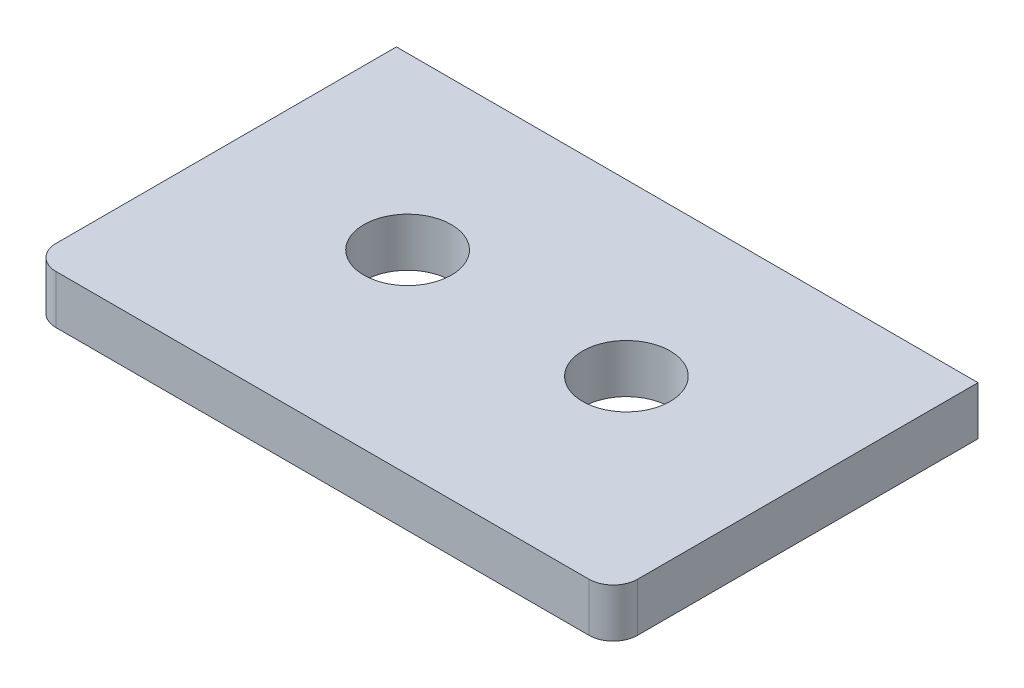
ISO-10303-21;
HEADER;
FILE_DESCRIPTION(('STEP AP214'),'2;1');
FILE_NAME('part.step','',(''),(''),'','','');
FILE_SCHEMA(('AUTOMOTIVE_DESIGN { 1 0 10303 214 1 1 1 1 }'));
ENDSEC;
DATA;
#1=APPLICATION_CONTEXT('core data for automotive mechanical design processes');
#2=APPLICATION_PROTOCOL_DEFINITION('international standard','automotive_design',2000,#1);
#3=PRODUCT_CONTEXT('',#1,'mechanical');
#4=PRODUCT('Part','Part','',(#3));
#5=PRODUCT_RELATED_PRODUCT_CATEGORY('part','',(#4));
#6=PRODUCT_DEFINITION_FORMATION('','',#4);
#7=PRODUCT_DEFINITION_CONTEXT('part definition',#1,'design');
#8=PRODUCT_DEFINITION('design','',#6,#7);
#9=PRODUCT_DEFINITION_SHAPE('','',#8);
#10=(LENGTH_UNIT() NAMED_UNIT(*) SI_UNIT(.MILLI.,.METRE.));
#11=(NAMED_UNIT(*) PLANE_ANGLE_UNIT() SI_UNIT($,.RADIAN.));
#12=(NAMED_UNIT(*) SI_UNIT($,.STERADIAN.) SOLID_ANGLE_UNIT());
#13=UNCERTAINTY_MEASURE_WITH_UNIT(LENGTH_MEASURE(1.E-05),#10,'distance_accuracy_value','');
#14=(GEOMETRIC_REPRESENTATION_CONTEXT(3) GLOBAL_UNCERTAINTY_ASSIGNED_CONTEXT((#13)) GLOBAL_UNIT_ASSIGNED_CONTEXT((#10,
#11,#12)) REPRESENTATION_CONTEXT('',''));
#15=CARTESIAN_POINT('',(0.,0.,0.));
#16=DIRECTION('',(0.,0.,1.));
#17=DIRECTION('',(1.,0.,0.));
#18=AXIS2_PLACEMENT_3D('',#15,#16,#17);
#19=CARTESIAN_POINT('',(29.9,-2.5,35.));
#20=DIRECTION('',(1.,0.,0.));
#21=DIRECTION('',(0.,0.,-1.));
#22=AXIS2_PLACEMENT_3D('',#19,#20,#21);
#23=PLANE('',#22);
#24=DIRECTION('',(0.,0.,-1.));
#25=VECTOR('',#24,1.);
#26=CARTESIAN_POINT('',(29.9,2.5,35.));
#27=LINE('',#26,#25);
#28=CARTESIAN_POINT('',(29.9,2.5,35.));
#29=VERTEX_POINT('',#28);
#30=CARTESIAN_POINT('',(29.9,2.5,0.));
#31=VERTEX_POINT('',#30);
#32=EDGE_CURVE('E120',#29,#31,#27,.T.);
#33=ORIENTED_EDGE('',*,*,#32,.F.);
#34=DIRECTION('',(0.,1.,0.));
#35=VECTOR('',#34,1.);
#36=CARTESIAN_POINT('',(29.9,-2.5,35.));
#37=LINE('',#36,#35);
#38=CARTESIAN_POINT('',(29.9,-2.5,35.));
#39=VERTEX_POINT('',#38);
#40=EDGE_CURVE('E11',#39,#29,#37,.T.);
#41=ORIENTED_EDGE('',*,*,#40,.F.);
#42=DIRECTION('',(0.,0.,-1.));
#43=VECTOR('',#42,1.);
#44=CARTESIAN_POINT('',(29.9,-2.5,35.));
#45=LINE('',#44,#43);
#46=CARTESIAN_POINT('',(29.9,-2.5,0.));
#47=VERTEX_POINT('',#46);
#48=EDGE_CURVE('E135',#39,#47,#45,.T.);
#49=ORIENTED_EDGE('',*,*,#48,.T.);
#50=DIRECTION('',(0.,1.,0.));
#51=VECTOR('',#50,1.);
#52=CARTESIAN_POINT('',(29.9,-2.5,0.));
#53=LINE('',#52,#51);
#54=EDGE_CURVE('E38',#47,#31,#53,.T.);
#55=ORIENTED_EDGE('',*,*,#54,.T.);
#56=EDGE_LOOP('',(#33,#41,#49,#55));
#57=FACE_BOUND('',#56,.T.);
#58=ADVANCED_FACE('F35',(#57),#23,.T.);
#59=CARTESIAN_POINT('',(27.4,-2.5,35.));
#60=DIRECTION('',(0.,1.,0.));
#61=DIRECTION('',(0.,0.,1.));
#62=AXIS2_PLACEMENT_3D('',#59,#60,#61);
#63=CYLINDRICAL_SURFACE('',#62,2.5);
#64=CARTESIAN_POINT('',(27.4,2.5,35.));
#65=DIRECTION('',(0.,1.,0.));
#66=DIRECTION('',(0.,0.,1.));
#67=AXIS2_PLACEMENT_3D('',#64,#65,#66);
#68=CIRCLE('',#67,2.5);
#69=CARTESIAN_POINT('',(27.4,2.5,37.5));
#70=VERTEX_POINT('',#69);
#71=EDGE_CURVE('E133',#70,#29,#68,.T.);
#72=ORIENTED_EDGE('',*,*,#71,.F.);
#73=DIRECTION('',(0.,1.,0.));
#74=VECTOR('',#73,1.);
#75=CARTESIAN_POINT('',(27.4,-2.5,37.5));
#76=LINE('',#75,#74);
#77=CARTESIAN_POINT('',(27.4,-2.5,37.5));
#78=VERTEX_POINT('',#77);
#79=EDGE_CURVE('E44',#78,#70,#76,.T.);
#80=ORIENTED_EDGE('',*,*,#79,.F.);
#81=CARTESIAN_POINT('',(27.4,-2.5,35.));
#82=DIRECTION('',(0.,1.,0.));
#83=DIRECTION('',(0.,0.,1.));
#84=AXIS2_PLACEMENT_3D('',#81,#82,#83);
#85=CIRCLE('',#84,2.5);
#86=EDGE_CURVE('E110',#78,#39,#85,.T.);
#87=ORIENTED_EDGE('',*,*,#86,.T.);
#88=ORIENTED_EDGE('',*,*,#40,.T.);
#89=EDGE_LOOP('',(#72,#80,#87,#88));
#90=FACE_BOUND('',#89,.T.);
#91=ADVANCED_FACE('F143',(#90),#63,.T.);
#92=CARTESIAN_POINT('',(-27.4,-2.5,37.5));
#93=DIRECTION('',(0.,0.,1.));
#94=DIRECTION('',(1.,0.,0.));
#95=AXIS2_PLACEMENT_3D('',#92,#93,#94);
#96=PLANE('',#95);
#97=DIRECTION('',(1.,0.,0.));
#98=VECTOR('',#97,1.);
#99=CARTESIAN_POINT('',(-27.4,2.5,37.5));
#100=LINE('',#99,#98);
#101=CARTESIAN_POINT('',(-27.4,2.5,37.5));
#102=VERTEX_POINT('',#101);
#103=EDGE_CURVE('E97',#102,#70,#100,.T.);
#104=ORIENTED_EDGE('',*,*,#103,.F.);
#105=DIRECTION('',(0.,1.,0.));
#106=VECTOR('',#105,1.);
#107=CARTESIAN_POINT('',(-27.4,-2.5,37.5));
#108=LINE('',#107,#106);
#109=CARTESIAN_POINT('',(-27.4,-2.5,37.5));
#110=VERTEX_POINT('',#109);
#111=EDGE_CURVE('E92',#110,#102,#108,.T.);
#112=ORIENTED_EDGE('',*,*,#111,.F.);
#113=DIRECTION('',(1.,0.,0.));
#114=VECTOR('',#113,1.);
#115=CARTESIAN_POINT('',(-27.4,-2.5,37.5));
#116=LINE('',#115,#114);
#117=EDGE_CURVE('E95',#110,#78,#116,.T.);
#118=ORIENTED_EDGE('',*,*,#117,.T.);
#119=ORIENTED_EDGE('',*,*,#79,.T.);
#120=EDGE_LOOP('',(#104,#112,#118,#119));
#121=FACE_BOUND('',#120,.T.);
#122=ADVANCED_FACE('F94',(#121),#96,.T.);
#123=CARTESIAN_POINT('',(-27.4,-2.5,35.));
#124=DIRECTION('',(0.,1.,0.));
#125=DIRECTION('',(0.,0.,1.));
#126=AXIS2_PLACEMENT_3D('',#123,#124,#125);
#127=CYLINDRICAL_SURFACE('',#126,2.5);
#128=CARTESIAN_POINT('',(-27.4,2.5,35.));
#129=DIRECTION('',(0.,1.,0.));
#130=DIRECTION('',(0.,0.,1.));
#131=AXIS2_PLACEMENT_3D('',#128,#129,#130);
#132=CIRCLE('',#131,2.5);
#133=CARTESIAN_POINT('',(-29.9,2.5,35.));
#134=VERTEX_POINT('',#133);
#135=EDGE_CURVE('E130',#134,#102,#132,.T.);
#136=ORIENTED_EDGE('',*,*,#135,.F.);
#137=DIRECTION('',(0.,1.,0.));
#138=VECTOR('',#137,1.);
#139=CARTESIAN_POINT('',(-29.9,-2.5,35.));
#140=LINE('',#139,#138);
#141=CARTESIAN_POINT('',(-29.9,-2.5,35.));
#142=VERTEX_POINT('',#141);
#143=EDGE_CURVE('E102',#142,#134,#140,.T.);
#144=ORIENTED_EDGE('',*,*,#143,.F.);
#145=CARTESIAN_POINT('',(-27.4,-2.5,35.));
#146=DIRECTION('',(0.,1.,0.));
#147=DIRECTION('',(0.,0.,1.));
#148=AXIS2_PLACEMENT_3D('',#145,#146,#147);
#149=CIRCLE('',#148,2.5);
#150=EDGE_CURVE('E108',#142,#110,#149,.T.);
#151=ORIENTED_EDGE('',*,*,#150,.T.);
#152=ORIENTED_EDGE('',*,*,#111,.T.);
#153=EDGE_LOOP('',(#136,#144,#151,#152));
#154=FACE_BOUND('',#153,.T.);
#155=ADVANCED_FACE('F112',(#154),#127,.T.);
#156=CARTESIAN_POINT('',(-29.9,-2.5,0.));
#157=DIRECTION('',(-1.,0.,0.));
#158=DIRECTION('',(0.,0.,1.));
#159=AXIS2_PLACEMENT_3D('',#156,#157,#158);
#160=PLANE('',#159);
#161=DIRECTION('',(0.,0.,1.));
#162=VECTOR('',#161,1.);
#163=CARTESIAN_POINT('',(-29.9,2.5,0.));
#164=LINE('',#163,#162);
#165=CARTESIAN_POINT('',(-29.9,2.5,0.));
#166=VERTEX_POINT('',#165);
#167=EDGE_CURVE('E127',#166,#134,#164,.T.);
#168=ORIENTED_EDGE('',*,*,#167,.F.);
#169=DIRECTION('',(0.,1.,0.));
#170=VECTOR('',#169,1.);
#171=CARTESIAN_POINT('',(-29.9,-2.5,0.));
#172=LINE('',#171,#170);
#173=CARTESIAN_POINT('',(-29.9,-2.5,0.));
#174=VERTEX_POINT('',#173);
#175=EDGE_CURVE('E138',#174,#166,#172,.T.);
#176=ORIENTED_EDGE('',*,*,#175,.F.);
#177=DIRECTION('',(0.,0.,1.));
#178=VECTOR('',#177,1.);
#179=CARTESIAN_POINT('',(-29.9,-2.5,0.));
#180=LINE('',#179,#178);
#181=EDGE_CURVE('E113',#174,#142,#180,.T.);
#182=ORIENTED_EDGE('',*,*,#181,.T.);
#183=ORIENTED_EDGE('',*,*,#143,.T.);
#184=EDGE_LOOP('',(#168,#176,#182,#183));
#185=FACE_BOUND('',#184,.T.);
#186=ADVANCED_FACE('F156',(#185),#160,.T.);
#187=CARTESIAN_POINT('',(29.9,-2.5,0.));
#188=DIRECTION('',(0.,0.,-1.));
#189=DIRECTION('',(-1.,0.,0.));
#190=AXIS2_PLACEMENT_3D('',#187,#188,#189);
#191=PLANE('',#190);
#192=DIRECTION('',(-1.,0.,0.));
#193=VECTOR('',#192,1.);
#194=CARTESIAN_POINT('',(29.9,2.5,0.));
#195=LINE('',#194,#193);
#196=EDGE_CURVE('E123',#31,#166,#195,.T.);
#197=ORIENTED_EDGE('',*,*,#196,.F.);
#198=ORIENTED_EDGE('',*,*,#54,.F.);
#199=DIRECTION('',(-1.,0.,0.));
#200=VECTOR('',#199,1.);
#201=CARTESIAN_POINT('',(29.9,-2.5,0.));
#202=LINE('',#201,#200);
#203=EDGE_CURVE('E115',#47,#174,#202,.T.);
#204=ORIENTED_EDGE('',*,*,#203,.T.);
#205=ORIENTED_EDGE('',*,*,#175,.T.);
#206=EDGE_LOOP('',(#197,#198,#204,#205));
#207=FACE_BOUND('',#206,.T.);
#208=ADVANCED_FACE('F140',(#207),#191,.T.);
#209=CARTESIAN_POINT('',(-27.4,-2.5,35.));
#210=DIRECTION('',(0.,1.,0.));
#211=DIRECTION('',(0.,0.,1.));
#212=AXIS2_PLACEMENT_3D('',#209,#210,#211);
#213=PLANE('',#212);
#214=CARTESIAN_POINT('',(-11.25,-2.5,17.5));
#215=DIRECTION('',(0.,1.,0.));
#216=DIRECTION('',(0.,0.,-1.));
#217=AXIS2_PLACEMENT_3D('',#214,#215,#216);
#218=CIRCLE('',#217,4.5);
#219=CARTESIAN_POINT('',(-11.25,-2.5,13.));
#220=VERTEX_POINT('',#219);
#221=EDGE_CURVE('E182',#220,#220,#218,.T.);
#222=ORIENTED_EDGE('',*,*,#221,.T.);
#223=EDGE_LOOP('',(#222));
#224=FACE_BOUND('',#223,.T.);
#225=CARTESIAN_POINT('',(11.25,-2.5,17.5));
#226=DIRECTION('',(0.,1.,0.));
#227=DIRECTION('',(0.,0.,-1.));
#228=AXIS2_PLACEMENT_3D('',#225,#226,#227);
#229=CIRCLE('',#228,4.5);
#230=CARTESIAN_POINT('',(11.25,-2.5,13.));
#231=VERTEX_POINT('',#230);
#232=EDGE_CURVE('E124',#231,#231,#229,.T.);
#233=ORIENTED_EDGE('',*,*,#232,.T.);
#234=EDGE_LOOP('',(#233));
#235=FACE_BOUND('',#234,.T.);
#236=ORIENTED_EDGE('',*,*,#48,.F.);
#237=ORIENTED_EDGE('',*,*,#86,.F.);
#238=ORIENTED_EDGE('',*,*,#117,.F.);
#239=ORIENTED_EDGE('',*,*,#150,.F.);
#240=ORIENTED_EDGE('',*,*,#181,.F.);
#241=ORIENTED_EDGE('',*,*,#203,.F.);
#242=EDGE_LOOP('',(#236,#237,#238,#239,#240,#241));
#243=FACE_BOUND('',#242,.T.);
#244=ADVANCED_FACE('F106',(#224,#235,#243),#213,.F.);
#245=CARTESIAN_POINT('',(-27.4,2.5,35.));
#246=DIRECTION('',(0.,1.,0.));
#247=DIRECTION('',(0.,0.,1.));
#248=AXIS2_PLACEMENT_3D('',#245,#246,#247);
#249=PLANE('',#248);
#250=CARTESIAN_POINT('',(-11.25,2.5,17.5));
#251=DIRECTION('',(0.,1.,0.));
#252=DIRECTION('',(0.,0.,-1.));
#253=AXIS2_PLACEMENT_3D('',#250,#251,#252);
#254=CIRCLE('',#253,4.5);
#255=CARTESIAN_POINT('',(-11.25,2.5,13.));
#256=VERTEX_POINT('',#255);
#257=EDGE_CURVE('E185',#256,#256,#254,.T.);
#258=ORIENTED_EDGE('',*,*,#257,.F.);
#259=EDGE_LOOP('',(#258));
#260=FACE_BOUND('',#259,.T.);
#261=CARTESIAN_POINT('',(11.25,2.5,17.5));
#262=DIRECTION('',(0.,1.,0.));
#263=DIRECTION('',(0.,0.,-1.));
#264=AXIS2_PLACEMENT_3D('',#261,#262,#263);
#265=CIRCLE('',#264,4.5);
#266=CARTESIAN_POINT('',(11.25,2.5,13.));
#267=VERTEX_POINT('',#266);
#268=EDGE_CURVE('E187',#267,#267,#265,.T.);
#269=ORIENTED_EDGE('',*,*,#268,.F.);
#270=EDGE_LOOP('',(#269));
#271=FACE_BOUND('',#270,.T.);
#272=ORIENTED_EDGE('',*,*,#32,.T.);
#273=ORIENTED_EDGE('',*,*,#196,.T.);
#274=ORIENTED_EDGE('',*,*,#167,.T.);
#275=ORIENTED_EDGE('',*,*,#135,.T.);
#276=ORIENTED_EDGE('',*,*,#103,.T.);
#277=ORIENTED_EDGE('',*,*,#71,.T.);
#278=EDGE_LOOP('',(#272,#273,#274,#275,#276,#277));
#279=FACE_BOUND('',#278,.T.);
#280=ADVANCED_FACE('F142',(#260,#271,#279),#249,.T.);
#281=CARTESIAN_POINT('',(11.25,-2.5,17.5));
#282=DIRECTION('',(0.,1.,0.));
#283=DIRECTION('',(0.,0.,1.));
#284=AXIS2_PLACEMENT_3D('',#281,#282,#283);
#285=CYLINDRICAL_SURFACE('',#284,4.5);
#286=ORIENTED_EDGE('',*,*,#232,.F.);
#287=EDGE_LOOP('',(#286));
#288=FACE_BOUND('',#287,.T.);
#289=ORIENTED_EDGE('',*,*,#268,.T.);
#290=EDGE_LOOP('',(#289));
#291=FACE_BOUND('',#290,.T.);
#292=ADVANCED_FACE('F167',(#288,#291),#285,.F.);
#293=CARTESIAN_POINT('',(-11.25,-2.5,17.5));
#294=DIRECTION('',(0.,1.,0.));
#295=DIRECTION('',(0.,0.,1.));
#296=AXIS2_PLACEMENT_3D('',#293,#294,#295);
#297=CYLINDRICAL_SURFACE('',#296,4.5);
#298=ORIENTED_EDGE('',*,*,#221,.F.);
#299=EDGE_LOOP('',(#298));
#300=FACE_BOUND('',#299,.T.);
#301=ORIENTED_EDGE('',*,*,#257,.T.);
#302=EDGE_LOOP('',(#301));
#303=FACE_BOUND('',#302,.T.);
#304=ADVANCED_FACE('F174',(#300,#303),#297,.F.);
#305=CLOSED_SHELL('',(#58,#91,#122,#155,#186,#208,#244,#280,#292,#304));
#306=MANIFOLD_SOLID_BREP('B2',#305);
#307=ADVANCED_BREP_SHAPE_REPRESENTATION('',(#18,#306),#14);
#308=SHAPE_DEFINITION_REPRESENTATION(#9,#307);
ENDSEC;
END-ISO-10303-21;
